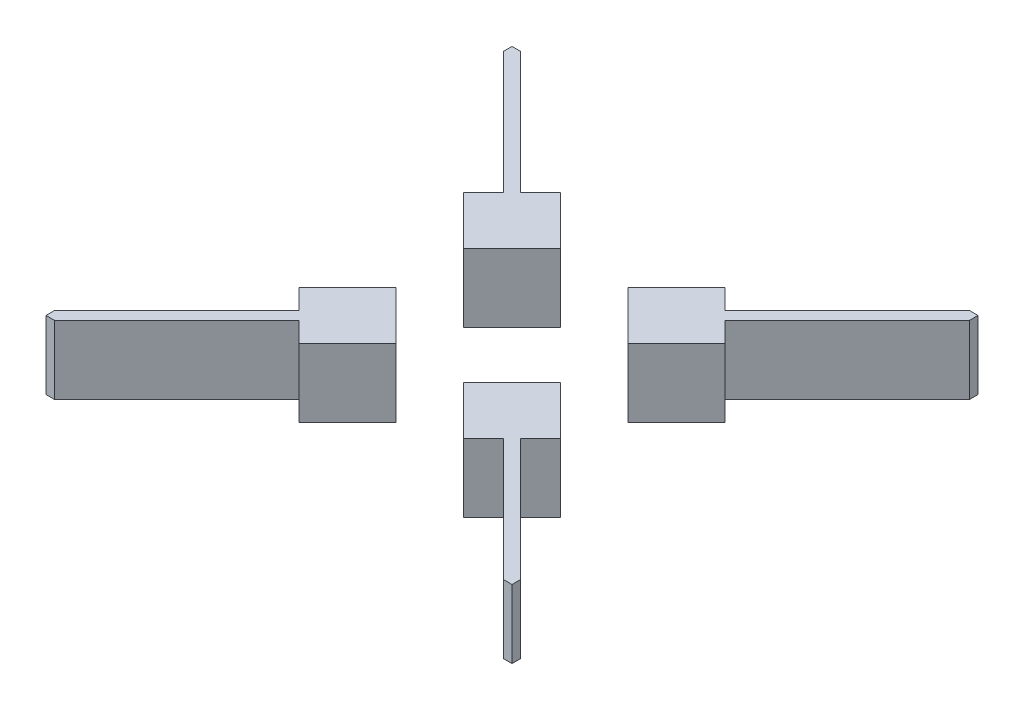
ISO-10303-21;
HEADER;
FILE_DESCRIPTION(('STEP AP214'),'2;1');
FILE_NAME('part.step','',(''),(''),'','','');
FILE_SCHEMA(('AUTOMOTIVE_DESIGN { 1 0 10303 214 1 1 1 1 }'));
ENDSEC;
DATA;
#1=APPLICATION_CONTEXT('core data for automotive mechanical design processes');
#2=APPLICATION_PROTOCOL_DEFINITION('international standard','automotive_design',2000,#1);
#3=PRODUCT_CONTEXT('',#1,'mechanical');
#4=PRODUCT('Part','Part','',(#3));
#5=PRODUCT_RELATED_PRODUCT_CATEGORY('part','',(#4));
#6=PRODUCT_DEFINITION_FORMATION('','',#4);
#7=PRODUCT_DEFINITION_CONTEXT('part definition',#1,'design');
#8=PRODUCT_DEFINITION('design','',#6,#7);
#9=PRODUCT_DEFINITION_SHAPE('','',#8);
#10=(LENGTH_UNIT() NAMED_UNIT(*) SI_UNIT(.MILLI.,.METRE.));
#11=(NAMED_UNIT(*) PLANE_ANGLE_UNIT() SI_UNIT($,.RADIAN.));
#12=(NAMED_UNIT(*) SI_UNIT($,.STERADIAN.) SOLID_ANGLE_UNIT());
#13=UNCERTAINTY_MEASURE_WITH_UNIT(LENGTH_MEASURE(1.E-05),#10,'distance_accuracy_value','');
#14=(GEOMETRIC_REPRESENTATION_CONTEXT(3) GLOBAL_UNCERTAINTY_ASSIGNED_CONTEXT((#13)) GLOBAL_UNIT_ASSIGNED_CONTEXT((#10,
#11,#12)) REPRESENTATION_CONTEXT('',''));
#15=CARTESIAN_POINT('',(0.,0.,0.));
#16=DIRECTION('',(0.,0.,1.));
#17=DIRECTION('',(1.,0.,0.));
#18=AXIS2_PLACEMENT_3D('',#15,#16,#17);
#19=CARTESIAN_POINT('',(9.53444210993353,5.,5.9989082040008));
#20=DIRECTION('',(-0.707106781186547,0.,0.707106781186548));
#21=DIRECTION('',(0.707106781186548,0.,0.707106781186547));
#22=AXIS2_PLACEMENT_3D('',#19,#20,#21);
#23=PLANE('',#22);
#24=DIRECTION('',(-0.707106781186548,0.,-0.707106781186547));
#25=VECTOR('',#24,1.);
#26=CARTESIAN_POINT('',(9.53444210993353,0.,5.9989082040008));
#27=LINE('',#26,#25);
#28=CARTESIAN_POINT('',(9.53444210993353,0.,5.9989082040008));
#29=VERTEX_POINT('',#28);
#30=CARTESIAN_POINT('',(5.9989082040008,0.,2.46337429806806));
#31=VERTEX_POINT('',#30);
#32=EDGE_CURVE('E152',#29,#31,#27,.T.);
#33=ORIENTED_EDGE('',*,*,#32,.T.);
#34=DIRECTION('',(0.,-1.,0.));
#35=VECTOR('',#34,1.);
#36=CARTESIAN_POINT('',(5.9989082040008,5.,2.46337429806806));
#37=LINE('',#36,#35);
#38=CARTESIAN_POINT('',(5.9989082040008,5.,2.46337429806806));
#39=VERTEX_POINT('',#38);
#40=EDGE_CURVE('E12',#39,#31,#37,.T.);
#41=ORIENTED_EDGE('',*,*,#40,.F.);
#42=DIRECTION('',(-0.707106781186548,0.,-0.707106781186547));
#43=VECTOR('',#42,1.);
#44=CARTESIAN_POINT('',(9.53444210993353,5.,5.9989082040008));
#45=LINE('',#44,#43);
#46=CARTESIAN_POINT('',(9.53444210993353,5.,5.9989082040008));
#47=VERTEX_POINT('',#46);
#48=EDGE_CURVE('E168',#47,#39,#45,.T.);
#49=ORIENTED_EDGE('',*,*,#48,.F.);
#50=DIRECTION('',(0.,-1.,0.));
#51=VECTOR('',#50,1.);
#52=CARTESIAN_POINT('',(9.53444210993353,5.,5.9989082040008));
#53=LINE('',#52,#51);
#54=EDGE_CURVE('E148',#47,#29,#53,.T.);
#55=ORIENTED_EDGE('',*,*,#54,.T.);
#56=EDGE_LOOP('',(#33,#41,#49,#55));
#57=FACE_BOUND('',#56,.T.);
#58=ADVANCED_FACE('F50',(#57),#23,.F.);
#59=CARTESIAN_POINT('',(5.9989082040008,5.,2.46337429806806));
#60=DIRECTION('',(0.707106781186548,0.,0.707106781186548));
#61=DIRECTION('',(0.707106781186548,0.,-0.707106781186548));
#62=AXIS2_PLACEMENT_3D('',#59,#60,#61);
#63=PLANE('',#62);
#64=DIRECTION('',(-0.707106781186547,0.,0.707106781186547));
#65=VECTOR('',#64,1.);
#66=CARTESIAN_POINT('',(5.9989082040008,0.,2.46337429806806));
#67=LINE('',#66,#65);
#68=CARTESIAN_POINT('',(2.46337429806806,0.,5.9989082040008));
#69=VERTEX_POINT('',#68);
#70=EDGE_CURVE('E155',#31,#69,#67,.T.);
#71=ORIENTED_EDGE('',*,*,#70,.T.);
#72=DIRECTION('',(0.,-1.,0.));
#73=VECTOR('',#72,1.);
#74=CARTESIAN_POINT('',(2.46337429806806,5.,5.9989082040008));
#75=LINE('',#74,#73);
#76=CARTESIAN_POINT('',(2.46337429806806,5.,5.9989082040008));
#77=VERTEX_POINT('',#76);
#78=EDGE_CURVE('E58',#77,#69,#75,.T.);
#79=ORIENTED_EDGE('',*,*,#78,.F.);
#80=DIRECTION('',(-0.707106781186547,0.,0.707106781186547));
#81=VECTOR('',#80,1.);
#82=CARTESIAN_POINT('',(5.9989082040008,5.,2.46337429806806));
#83=LINE('',#82,#81);
#84=EDGE_CURVE('E112',#39,#77,#83,.T.);
#85=ORIENTED_EDGE('',*,*,#84,.F.);
#86=ORIENTED_EDGE('',*,*,#40,.T.);
#87=EDGE_LOOP('',(#71,#79,#85,#86));
#88=FACE_BOUND('',#87,.T.);
#89=ADVANCED_FACE('F211',(#88),#63,.F.);
#90=CARTESIAN_POINT('',(5.9989082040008,5.,9.53444210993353));
#91=DIRECTION('',(0.707106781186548,0.,-0.707106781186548));
#92=DIRECTION('',(-0.707106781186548,0.,-0.707106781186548));
#93=AXIS2_PLACEMENT_3D('',#90,#91,#92);
#94=PLANE('',#93);
#95=DIRECTION('',(0.707106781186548,0.,0.707106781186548));
#96=VECTOR('',#95,1.);
#97=CARTESIAN_POINT('',(5.9989082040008,0.,9.53444210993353));
#98=LINE('',#97,#96);
#99=CARTESIAN_POINT('',(5.9989082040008,0.,9.53444210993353));
#100=VERTEX_POINT('',#99);
#101=EDGE_CURVE('E157',#69,#100,#98,.T.);
#102=ORIENTED_EDGE('',*,*,#101,.T.);
#103=DIRECTION('',(0.,-1.,0.));
#104=VECTOR('',#103,1.);
#105=CARTESIAN_POINT('',(5.9989082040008,5.,9.53444210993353));
#106=LINE('',#105,#104);
#107=CARTESIAN_POINT('',(5.9989082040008,5.,9.53444210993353));
#108=VERTEX_POINT('',#107);
#109=EDGE_CURVE('E178',#108,#100,#106,.T.);
#110=ORIENTED_EDGE('',*,*,#109,.F.);
#111=DIRECTION('',(0.707106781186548,0.,0.707106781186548));
#112=VECTOR('',#111,1.);
#113=CARTESIAN_POINT('',(5.9989082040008,5.,9.53444210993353));
#114=LINE('',#113,#112);
#115=EDGE_CURVE('E186',#77,#108,#114,.T.);
#116=ORIENTED_EDGE('',*,*,#115,.F.);
#117=ORIENTED_EDGE('',*,*,#78,.T.);
#118=EDGE_LOOP('',(#102,#110,#116,#117));
#119=FACE_BOUND('',#118,.T.);
#120=ADVANCED_FACE('F184',(#119),#94,.F.);
#121=CARTESIAN_POINT('',(7.44900397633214,5.,8.0843463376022));
#122=DIRECTION('',(-0.707106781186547,0.,-0.707106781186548));
#123=DIRECTION('',(-0.707106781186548,0.,0.707106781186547));
#124=AXIS2_PLACEMENT_3D('',#121,#122,#123);
#125=PLANE('',#124);
#126=DIRECTION('',(0.707106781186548,0.,-0.707106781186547));
#127=VECTOR('',#126,1.);
#128=CARTESIAN_POINT('',(7.44900397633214,0.,8.0843463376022));
#129=LINE('',#128,#127);
#130=CARTESIAN_POINT('',(7.44900397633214,0.,8.0843463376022));
#131=VERTEX_POINT('',#130);
#132=EDGE_CURVE('E159',#100,#131,#129,.T.);
#133=ORIENTED_EDGE('',*,*,#132,.T.);
#134=DIRECTION('',(0.,-1.,0.));
#135=VECTOR('',#134,1.);
#136=CARTESIAN_POINT('',(7.44900397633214,5.,8.0843463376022));
#137=LINE('',#136,#135);
#138=CARTESIAN_POINT('',(7.44900397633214,5.,8.0843463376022));
#139=VERTEX_POINT('',#138);
#140=EDGE_CURVE('E175',#139,#131,#137,.T.);
#141=ORIENTED_EDGE('',*,*,#140,.F.);
#142=DIRECTION('',(0.707106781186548,0.,-0.707106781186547));
#143=VECTOR('',#142,1.);
#144=CARTESIAN_POINT('',(7.44900397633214,5.,8.0843463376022));
#145=LINE('',#144,#143);
#146=EDGE_CURVE('E202',#108,#139,#145,.T.);
#147=ORIENTED_EDGE('',*,*,#146,.F.);
#148=ORIENTED_EDGE('',*,*,#109,.T.);
#149=EDGE_LOOP('',(#133,#141,#147,#148));
#150=FACE_BOUND('',#149,.T.);
#151=ADVANCED_FACE('F195',(#150),#125,.F.);
#152=CARTESIAN_POINT('',(7.44900397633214,5.,8.0843463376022));
#153=DIRECTION('',(0.707106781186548,0.,-0.707106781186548));
#154=DIRECTION('',(-0.707106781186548,0.,-0.707106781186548));
#155=AXIS2_PLACEMENT_3D('',#152,#153,#154);
#156=PLANE('',#155);
#157=DIRECTION('',(0.707106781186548,0.,0.707106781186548));
#158=VECTOR('',#157,1.);
#159=CARTESIAN_POINT('',(7.44900397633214,0.,8.0843463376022));
#160=LINE('',#159,#158);
#161=CARTESIAN_POINT('',(16.3646576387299,0.,17.));
#162=VERTEX_POINT('',#161);
#163=EDGE_CURVE('E161',#131,#162,#160,.T.);
#164=ORIENTED_EDGE('',*,*,#163,.T.);
#165=DIRECTION('',(0.,-1.,0.));
#166=VECTOR('',#165,1.);
#167=CARTESIAN_POINT('',(16.3646576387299,5.,17.));
#168=LINE('',#167,#166);
#169=CARTESIAN_POINT('',(16.3646576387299,5.,17.));
#170=VERTEX_POINT('',#169);
#171=EDGE_CURVE('E172',#170,#162,#168,.T.);
#172=ORIENTED_EDGE('',*,*,#171,.F.);
#173=DIRECTION('',(0.707106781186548,0.,0.707106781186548));
#174=VECTOR('',#173,1.);
#175=CARTESIAN_POINT('',(7.44900397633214,5.,8.0843463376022));
#176=LINE('',#175,#174);
#177=EDGE_CURVE('E201',#139,#170,#176,.T.);
#178=ORIENTED_EDGE('',*,*,#177,.F.);
#179=ORIENTED_EDGE('',*,*,#140,.T.);
#180=EDGE_LOOP('',(#164,#172,#178,#179));
#181=FACE_BOUND('',#180,.T.);
#182=ADVANCED_FACE('F199',(#181),#156,.F.);
#183=CARTESIAN_POINT('',(17.,5.,17.));
#184=DIRECTION('',(0.,0.,-1.));
#185=DIRECTION('',(-1.,0.,0.));
#186=AXIS2_PLACEMENT_3D('',#183,#184,#185);
#187=PLANE('',#186);
#188=DIRECTION('',(1.,0.,0.));
#189=VECTOR('',#188,1.);
#190=CARTESIAN_POINT('',(17.,0.,17.));
#191=LINE('',#190,#189);
#192=CARTESIAN_POINT('',(17.,0.,17.));
#193=VERTEX_POINT('',#192);
#194=EDGE_CURVE('E163',#162,#193,#191,.T.);
#195=ORIENTED_EDGE('',*,*,#194,.T.);
#196=DIRECTION('',(0.,-1.,0.));
#197=VECTOR('',#196,1.);
#198=CARTESIAN_POINT('',(17.,5.,17.));
#199=LINE('',#198,#197);
#200=CARTESIAN_POINT('',(17.,5.,17.));
#201=VERTEX_POINT('',#200);
#202=EDGE_CURVE('E143',#201,#193,#199,.T.);
#203=ORIENTED_EDGE('',*,*,#202,.F.);
#204=DIRECTION('',(1.,0.,0.));
#205=VECTOR('',#204,1.);
#206=CARTESIAN_POINT('',(17.,5.,17.));
#207=LINE('',#206,#205);
#208=EDGE_CURVE('E134',#170,#201,#207,.T.);
#209=ORIENTED_EDGE('',*,*,#208,.F.);
#210=ORIENTED_EDGE('',*,*,#171,.T.);
#211=EDGE_LOOP('',(#195,#203,#209,#210));
#212=FACE_BOUND('',#211,.T.);
#213=ADVANCED_FACE('F223',(#212),#187,.F.);
#214=CARTESIAN_POINT('',(17.,5.,17.));
#215=DIRECTION('',(-1.,0.,0.));
#216=DIRECTION('',(0.,0.,1.));
#217=AXIS2_PLACEMENT_3D('',#214,#215,#216);
#218=PLANE('',#217);
#219=DIRECTION('',(0.,0.,-1.));
#220=VECTOR('',#219,1.);
#221=CARTESIAN_POINT('',(17.,0.,17.));
#222=LINE('',#221,#220);
#223=CARTESIAN_POINT('',(17.,0.,16.3646576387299));
#224=VERTEX_POINT('',#223);
#225=EDGE_CURVE('E142',#193,#224,#222,.T.);
#226=ORIENTED_EDGE('',*,*,#225,.T.);
#227=DIRECTION('',(0.,-1.,0.));
#228=VECTOR('',#227,1.);
#229=CARTESIAN_POINT('',(17.,5.,16.3646576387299));
#230=LINE('',#229,#228);
#231=CARTESIAN_POINT('',(17.,5.,16.3646576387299));
#232=VERTEX_POINT('',#231);
#233=EDGE_CURVE('E139',#232,#224,#230,.T.);
#234=ORIENTED_EDGE('',*,*,#233,.F.);
#235=DIRECTION('',(0.,0.,-1.));
#236=VECTOR('',#235,1.);
#237=CARTESIAN_POINT('',(17.,5.,17.));
#238=LINE('',#237,#236);
#239=EDGE_CURVE('E128',#201,#232,#238,.T.);
#240=ORIENTED_EDGE('',*,*,#239,.F.);
#241=ORIENTED_EDGE('',*,*,#202,.T.);
#242=EDGE_LOOP('',(#226,#234,#240,#241));
#243=FACE_BOUND('',#242,.T.);
#244=ADVANCED_FACE('F140',(#243),#218,.F.);
#245=CARTESIAN_POINT('',(8.0843463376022,5.,7.44900397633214));
#246=DIRECTION('',(-0.707106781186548,0.,0.707106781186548));
#247=DIRECTION('',(0.707106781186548,0.,0.707106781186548));
#248=AXIS2_PLACEMENT_3D('',#245,#246,#247);
#249=PLANE('',#248);
#250=DIRECTION('',(-0.707106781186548,0.,-0.707106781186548));
#251=VECTOR('',#250,1.);
#252=CARTESIAN_POINT('',(8.0843463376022,0.,7.44900397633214));
#253=LINE('',#252,#251);
#254=CARTESIAN_POINT('',(8.0843463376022,0.,7.44900397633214));
#255=VERTEX_POINT('',#254);
#256=EDGE_CURVE('E98',#224,#255,#253,.T.);
#257=ORIENTED_EDGE('',*,*,#256,.T.);
#258=DIRECTION('',(0.,-1.,0.));
#259=VECTOR('',#258,1.);
#260=CARTESIAN_POINT('',(8.0843463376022,5.,7.44900397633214));
#261=LINE('',#260,#259);
#262=CARTESIAN_POINT('',(8.0843463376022,5.,7.44900397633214));
#263=VERTEX_POINT('',#262);
#264=EDGE_CURVE('E144',#263,#255,#261,.T.);
#265=ORIENTED_EDGE('',*,*,#264,.F.);
#266=DIRECTION('',(-0.707106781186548,0.,-0.707106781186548));
#267=VECTOR('',#266,1.);
#268=CARTESIAN_POINT('',(8.0843463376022,5.,7.44900397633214));
#269=LINE('',#268,#267);
#270=EDGE_CURVE('E132',#232,#263,#269,.T.);
#271=ORIENTED_EDGE('',*,*,#270,.F.);
#272=ORIENTED_EDGE('',*,*,#233,.T.);
#273=EDGE_LOOP('',(#257,#265,#271,#272));
#274=FACE_BOUND('',#273,.T.);
#275=ADVANCED_FACE('F146',(#274),#249,.F.);
#276=CARTESIAN_POINT('',(9.53444210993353,5.,5.9989082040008));
#277=DIRECTION('',(-0.707106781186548,0.,-0.707106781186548));
#278=DIRECTION('',(-0.707106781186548,0.,0.707106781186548));
#279=AXIS2_PLACEMENT_3D('',#276,#277,#278);
#280=PLANE('',#279);
#281=DIRECTION('',(0.707106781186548,0.,-0.707106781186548));
#282=VECTOR('',#281,1.);
#283=CARTESIAN_POINT('',(9.53444210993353,0.,5.9989082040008));
#284=LINE('',#283,#282);
#285=EDGE_CURVE('E104',#255,#29,#284,.T.);
#286=ORIENTED_EDGE('',*,*,#285,.T.);
#287=ORIENTED_EDGE('',*,*,#54,.F.);
#288=DIRECTION('',(0.707106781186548,0.,-0.707106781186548));
#289=VECTOR('',#288,1.);
#290=CARTESIAN_POINT('',(9.53444210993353,5.,5.9989082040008));
#291=LINE('',#290,#289);
#292=EDGE_CURVE('E66',#263,#47,#291,.T.);
#293=ORIENTED_EDGE('',*,*,#292,.F.);
#294=ORIENTED_EDGE('',*,*,#264,.T.);
#295=EDGE_LOOP('',(#286,#287,#293,#294));
#296=FACE_BOUND('',#295,.T.);
#297=ADVANCED_FACE('F231',(#296),#280,.F.);
#298=CARTESIAN_POINT('',(0.,5.,0.));
#299=DIRECTION('',(0.,1.,0.));
#300=DIRECTION('',(0.,0.,1.));
#301=AXIS2_PLACEMENT_3D('',#298,#299,#300);
#302=PLANE('',#301);
#303=ORIENTED_EDGE('',*,*,#48,.T.);
#304=ORIENTED_EDGE('',*,*,#84,.T.);
#305=ORIENTED_EDGE('',*,*,#115,.T.);
#306=ORIENTED_EDGE('',*,*,#146,.T.);
#307=ORIENTED_EDGE('',*,*,#177,.T.);
#308=ORIENTED_EDGE('',*,*,#208,.T.);
#309=ORIENTED_EDGE('',*,*,#239,.T.);
#310=ORIENTED_EDGE('',*,*,#270,.T.);
#311=ORIENTED_EDGE('',*,*,#292,.T.);
#312=EDGE_LOOP('',(#303,#304,#305,#306,#307,#308,#309,#310,#311));
#313=FACE_BOUND('',#312,.T.);
#314=ADVANCED_FACE('F130',(#313),#302,.T.);
#315=CARTESIAN_POINT('',(0.,0.,0.));
#316=DIRECTION('',(0.,1.,0.));
#317=DIRECTION('',(0.,0.,1.));
#318=AXIS2_PLACEMENT_3D('',#315,#316,#317);
#319=PLANE('',#318);
#320=ORIENTED_EDGE('',*,*,#32,.F.);
#321=ORIENTED_EDGE('',*,*,#285,.F.);
#322=ORIENTED_EDGE('',*,*,#256,.F.);
#323=ORIENTED_EDGE('',*,*,#225,.F.);
#324=ORIENTED_EDGE('',*,*,#194,.F.);
#325=ORIENTED_EDGE('',*,*,#163,.F.);
#326=ORIENTED_EDGE('',*,*,#132,.F.);
#327=ORIENTED_EDGE('',*,*,#101,.F.);
#328=ORIENTED_EDGE('',*,*,#70,.F.);
#329=EDGE_LOOP('',(#320,#321,#322,#323,#324,#325,#326,#327,#328));
#330=FACE_BOUND('',#329,.T.);
#331=ADVANCED_FACE('F190',(#330),#319,.F.);
#332=CLOSED_SHELL('',(#58,#89,#120,#151,#182,#213,#244,#275,#297,#314,#331));
#333=MANIFOLD_SOLID_BREP('B2',#332);
#334=CARTESIAN_POINT('',(-9.53444210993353,5.,5.9989082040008));
#335=DIRECTION('',(0.707106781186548,0.,-0.707106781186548));
#336=DIRECTION('',(-0.707106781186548,0.,-0.707106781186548));
#337=AXIS2_PLACEMENT_3D('',#334,#335,#336);
#338=PLANE('',#337);
#339=DIRECTION('',(0.707106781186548,0.,0.707106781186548));
#340=VECTOR('',#339,1.);
#341=CARTESIAN_POINT('',(-9.53444210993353,0.,5.9989082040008));
#342=LINE('',#341,#340);
#343=CARTESIAN_POINT('',(-9.53444210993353,0.,5.9989082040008));
#344=VERTEX_POINT('',#343);
#345=CARTESIAN_POINT('',(-8.0843463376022,0.,7.44900397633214));
#346=VERTEX_POINT('',#345);
#347=EDGE_CURVE('E416',#344,#346,#342,.T.);
#348=ORIENTED_EDGE('',*,*,#347,.T.);
#349=DIRECTION('',(0.,-1.,0.));
#350=VECTOR('',#349,1.);
#351=CARTESIAN_POINT('',(-8.0843463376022,5.,7.44900397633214));
#352=LINE('',#351,#350);
#353=CARTESIAN_POINT('',(-8.0843463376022,5.,7.44900397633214));
#354=VERTEX_POINT('',#353);
#355=EDGE_CURVE('E48',#354,#346,#352,.T.);
#356=ORIENTED_EDGE('',*,*,#355,.F.);
#357=DIRECTION('',(0.707106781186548,0.,0.707106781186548));
#358=VECTOR('',#357,1.);
#359=CARTESIAN_POINT('',(-9.53444210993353,5.,5.9989082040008));
#360=LINE('',#359,#358);
#361=CARTESIAN_POINT('',(-9.53444210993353,5.,5.9989082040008));
#362=VERTEX_POINT('',#361);
#363=EDGE_CURVE('E432',#362,#354,#360,.T.);
#364=ORIENTED_EDGE('',*,*,#363,.F.);
#365=DIRECTION('',(0.,-1.,0.));
#366=VECTOR('',#365,1.);
#367=CARTESIAN_POINT('',(-9.53444210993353,5.,5.9989082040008));
#368=LINE('',#367,#366);
#369=EDGE_CURVE('E412',#362,#344,#368,.T.);
#370=ORIENTED_EDGE('',*,*,#369,.T.);
#371=EDGE_LOOP('',(#348,#356,#364,#370));
#372=FACE_BOUND('',#371,.T.);
#373=ADVANCED_FACE('F314',(#372),#338,.F.);
#374=CARTESIAN_POINT('',(-8.0843463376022,5.,7.44900397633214));
#375=DIRECTION('',(0.707106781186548,0.,0.707106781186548));
#376=DIRECTION('',(0.707106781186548,0.,-0.707106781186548));
#377=AXIS2_PLACEMENT_3D('',#374,#375,#376);
#378=PLANE('',#377);
#379=DIRECTION('',(-0.707106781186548,0.,0.707106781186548));
#380=VECTOR('',#379,1.);
#381=CARTESIAN_POINT('',(-8.0843463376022,0.,7.44900397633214));
#382=LINE('',#381,#380);
#383=CARTESIAN_POINT('',(-17.,0.,16.3646576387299));
#384=VERTEX_POINT('',#383);
#385=EDGE_CURVE('E419',#346,#384,#382,.T.);
#386=ORIENTED_EDGE('',*,*,#385,.T.);
#387=DIRECTION('',(0.,-1.,0.));
#388=VECTOR('',#387,1.);
#389=CARTESIAN_POINT('',(-17.,5.,16.3646576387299));
#390=LINE('',#389,#388);
#391=CARTESIAN_POINT('',(-17.,5.,16.3646576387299));
#392=VERTEX_POINT('',#391);
#393=EDGE_CURVE('E322',#392,#384,#390,.T.);
#394=ORIENTED_EDGE('',*,*,#393,.F.);
#395=DIRECTION('',(-0.707106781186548,0.,0.707106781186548));
#396=VECTOR('',#395,1.);
#397=CARTESIAN_POINT('',(-8.0843463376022,5.,7.44900397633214));
#398=LINE('',#397,#396);
#399=EDGE_CURVE('E376',#354,#392,#398,.T.);
#400=ORIENTED_EDGE('',*,*,#399,.F.);
#401=ORIENTED_EDGE('',*,*,#355,.T.);
#402=EDGE_LOOP('',(#386,#394,#400,#401));
#403=FACE_BOUND('',#402,.T.);
#404=ADVANCED_FACE('F475',(#403),#378,.F.);
#405=CARTESIAN_POINT('',(-17.,5.,17.));
#406=DIRECTION('',(1.,0.,0.));
#407=DIRECTION('',(0.,0.,-1.));
#408=AXIS2_PLACEMENT_3D('',#405,#406,#407);
#409=PLANE('',#408);
#410=DIRECTION('',(0.,0.,1.));
#411=VECTOR('',#410,1.);
#412=CARTESIAN_POINT('',(-17.,0.,17.));
#413=LINE('',#412,#411);
#414=CARTESIAN_POINT('',(-17.,0.,17.));
#415=VERTEX_POINT('',#414);
#416=EDGE_CURVE('E421',#384,#415,#413,.T.);
#417=ORIENTED_EDGE('',*,*,#416,.T.);
#418=DIRECTION('',(0.,-1.,0.));
#419=VECTOR('',#418,1.);
#420=CARTESIAN_POINT('',(-17.,5.,17.));
#421=LINE('',#420,#419);
#422=CARTESIAN_POINT('',(-17.,5.,17.));
#423=VERTEX_POINT('',#422);
#424=EDGE_CURVE('E442',#423,#415,#421,.T.);
#425=ORIENTED_EDGE('',*,*,#424,.F.);
#426=DIRECTION('',(0.,0.,1.));
#427=VECTOR('',#426,1.);
#428=CARTESIAN_POINT('',(-17.,5.,17.));
#429=LINE('',#428,#427);
#430=EDGE_CURVE('E450',#392,#423,#429,.T.);
#431=ORIENTED_EDGE('',*,*,#430,.F.);
#432=ORIENTED_EDGE('',*,*,#393,.T.);
#433=EDGE_LOOP('',(#417,#425,#431,#432));
#434=FACE_BOUND('',#433,.T.);
#435=ADVANCED_FACE('F448',(#434),#409,.F.);
#436=CARTESIAN_POINT('',(-17.,5.,17.));
#437=DIRECTION('',(0.,0.,-1.));
#438=DIRECTION('',(-1.,0.,0.));
#439=AXIS2_PLACEMENT_3D('',#436,#437,#438);
#440=PLANE('',#439);
#441=DIRECTION('',(1.,0.,0.));
#442=VECTOR('',#441,1.);
#443=CARTESIAN_POINT('',(-17.,0.,17.));
#444=LINE('',#443,#442);
#445=CARTESIAN_POINT('',(-16.3646576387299,0.,17.));
#446=VERTEX_POINT('',#445);
#447=EDGE_CURVE('E423',#415,#446,#444,.T.);
#448=ORIENTED_EDGE('',*,*,#447,.T.);
#449=DIRECTION('',(0.,-1.,0.));
#450=VECTOR('',#449,1.);
#451=CARTESIAN_POINT('',(-16.3646576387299,5.,17.));
#452=LINE('',#451,#450);
#453=CARTESIAN_POINT('',(-16.3646576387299,5.,17.));
#454=VERTEX_POINT('',#453);
#455=EDGE_CURVE('E439',#454,#446,#452,.T.);
#456=ORIENTED_EDGE('',*,*,#455,.F.);
#457=DIRECTION('',(1.,0.,0.));
#458=VECTOR('',#457,1.);
#459=CARTESIAN_POINT('',(-17.,5.,17.));
#460=LINE('',#459,#458);
#461=EDGE_CURVE('E466',#423,#454,#460,.T.);
#462=ORIENTED_EDGE('',*,*,#461,.F.);
#463=ORIENTED_EDGE('',*,*,#424,.T.);
#464=EDGE_LOOP('',(#448,#456,#462,#463));
#465=FACE_BOUND('',#464,.T.);
#466=ADVANCED_FACE('F459',(#465),#440,.F.);
#467=CARTESIAN_POINT('',(-7.44900397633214,5.,8.0843463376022));
#468=DIRECTION('',(-0.707106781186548,0.,-0.707106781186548));
#469=DIRECTION('',(-0.707106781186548,0.,0.707106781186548));
#470=AXIS2_PLACEMENT_3D('',#467,#468,#469);
#471=PLANE('',#470);
#472=DIRECTION('',(0.707106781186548,0.,-0.707106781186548));
#473=VECTOR('',#472,1.);
#474=CARTESIAN_POINT('',(-7.44900397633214,0.,8.0843463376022));
#475=LINE('',#474,#473);
#476=CARTESIAN_POINT('',(-7.44900397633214,0.,8.0843463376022));
#477=VERTEX_POINT('',#476);
#478=EDGE_CURVE('E425',#446,#477,#475,.T.);
#479=ORIENTED_EDGE('',*,*,#478,.T.);
#480=DIRECTION('',(0.,-1.,0.));
#481=VECTOR('',#480,1.);
#482=CARTESIAN_POINT('',(-7.44900397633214,5.,8.0843463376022));
#483=LINE('',#482,#481);
#484=CARTESIAN_POINT('',(-7.44900397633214,5.,8.0843463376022));
#485=VERTEX_POINT('',#484);
#486=EDGE_CURVE('E436',#485,#477,#483,.T.);
#487=ORIENTED_EDGE('',*,*,#486,.F.);
#488=DIRECTION('',(0.707106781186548,0.,-0.707106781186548));
#489=VECTOR('',#488,1.);
#490=CARTESIAN_POINT('',(-7.44900397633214,5.,8.0843463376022));
#491=LINE('',#490,#489);
#492=EDGE_CURVE('E465',#454,#485,#491,.T.);
#493=ORIENTED_EDGE('',*,*,#492,.F.);
#494=ORIENTED_EDGE('',*,*,#455,.T.);
#495=EDGE_LOOP('',(#479,#487,#493,#494));
#496=FACE_BOUND('',#495,.T.);
#497=ADVANCED_FACE('F463',(#496),#471,.F.);
#498=CARTESIAN_POINT('',(-7.44900397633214,5.,8.0843463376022));
#499=DIRECTION('',(0.707106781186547,0.,-0.707106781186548));
#500=DIRECTION('',(-0.707106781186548,0.,-0.707106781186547));
#501=AXIS2_PLACEMENT_3D('',#498,#499,#500);
#502=PLANE('',#501);
#503=DIRECTION('',(0.707106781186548,0.,0.707106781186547));
#504=VECTOR('',#503,1.);
#505=CARTESIAN_POINT('',(-7.44900397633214,0.,8.0843463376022));
#506=LINE('',#505,#504);
#507=CARTESIAN_POINT('',(-5.9989082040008,0.,9.53444210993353));
#508=VERTEX_POINT('',#507);
#509=EDGE_CURVE('E427',#477,#508,#506,.T.);
#510=ORIENTED_EDGE('',*,*,#509,.T.);
#511=DIRECTION('',(0.,-1.,0.));
#512=VECTOR('',#511,1.);
#513=CARTESIAN_POINT('',(-5.9989082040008,5.,9.53444210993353));
#514=LINE('',#513,#512);
#515=CARTESIAN_POINT('',(-5.9989082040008,5.,9.53444210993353));
#516=VERTEX_POINT('',#515);
#517=EDGE_CURVE('E407',#516,#508,#514,.T.);
#518=ORIENTED_EDGE('',*,*,#517,.F.);
#519=DIRECTION('',(0.707106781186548,0.,0.707106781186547));
#520=VECTOR('',#519,1.);
#521=CARTESIAN_POINT('',(-7.44900397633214,5.,8.0843463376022));
#522=LINE('',#521,#520);
#523=EDGE_CURVE('E398',#485,#516,#522,.T.);
#524=ORIENTED_EDGE('',*,*,#523,.F.);
#525=ORIENTED_EDGE('',*,*,#486,.T.);
#526=EDGE_LOOP('',(#510,#518,#524,#525));
#527=FACE_BOUND('',#526,.T.);
#528=ADVANCED_FACE('F487',(#527),#502,.F.);
#529=CARTESIAN_POINT('',(-5.9989082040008,5.,9.53444210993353));
#530=DIRECTION('',(-0.707106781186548,0.,-0.707106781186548));
#531=DIRECTION('',(-0.707106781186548,0.,0.707106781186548));
#532=AXIS2_PLACEMENT_3D('',#529,#530,#531);
#533=PLANE('',#532);
#534=DIRECTION('',(0.707106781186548,0.,-0.707106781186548));
#535=VECTOR('',#534,1.);
#536=CARTESIAN_POINT('',(-5.9989082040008,0.,9.53444210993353));
#537=LINE('',#536,#535);
#538=CARTESIAN_POINT('',(-2.46337429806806,0.,5.9989082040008));
#539=VERTEX_POINT('',#538);
#540=EDGE_CURVE('E406',#508,#539,#537,.T.);
#541=ORIENTED_EDGE('',*,*,#540,.T.);
#542=DIRECTION('',(0.,-1.,0.));
#543=VECTOR('',#542,1.);
#544=CARTESIAN_POINT('',(-2.46337429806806,5.,5.9989082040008));
#545=LINE('',#544,#543);
#546=CARTESIAN_POINT('',(-2.46337429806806,5.,5.9989082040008));
#547=VERTEX_POINT('',#546);
#548=EDGE_CURVE('E403',#547,#539,#545,.T.);
#549=ORIENTED_EDGE('',*,*,#548,.F.);
#550=DIRECTION('',(0.707106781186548,0.,-0.707106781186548));
#551=VECTOR('',#550,1.);
#552=CARTESIAN_POINT('',(-5.9989082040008,5.,9.53444210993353));
#553=LINE('',#552,#551);
#554=EDGE_CURVE('E392',#516,#547,#553,.T.);
#555=ORIENTED_EDGE('',*,*,#554,.F.);
#556=ORIENTED_EDGE('',*,*,#517,.T.);
#557=EDGE_LOOP('',(#541,#549,#555,#556));
#558=FACE_BOUND('',#557,.T.);
#559=ADVANCED_FACE('F404',(#558),#533,.F.);
#560=CARTESIAN_POINT('',(-5.9989082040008,5.,2.46337429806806));
#561=DIRECTION('',(-0.707106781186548,0.,0.707106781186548));
#562=DIRECTION('',(0.707106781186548,0.,0.707106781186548));
#563=AXIS2_PLACEMENT_3D('',#560,#561,#562);
#564=PLANE('',#563);
#565=DIRECTION('',(-0.707106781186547,0.,-0.707106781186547));
#566=VECTOR('',#565,1.);
#567=CARTESIAN_POINT('',(-5.9989082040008,0.,2.46337429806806));
#568=LINE('',#567,#566);
#569=CARTESIAN_POINT('',(-5.9989082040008,0.,2.46337429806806));
#570=VERTEX_POINT('',#569);
#571=EDGE_CURVE('E362',#539,#570,#568,.T.);
#572=ORIENTED_EDGE('',*,*,#571,.T.);
#573=DIRECTION('',(0.,-1.,0.));
#574=VECTOR('',#573,1.);
#575=CARTESIAN_POINT('',(-5.9989082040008,5.,2.46337429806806));
#576=LINE('',#575,#574);
#577=CARTESIAN_POINT('',(-5.9989082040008,5.,2.46337429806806));
#578=VERTEX_POINT('',#577);
#579=EDGE_CURVE('E408',#578,#570,#576,.T.);
#580=ORIENTED_EDGE('',*,*,#579,.F.);
#581=DIRECTION('',(-0.707106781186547,0.,-0.707106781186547));
#582=VECTOR('',#581,1.);
#583=CARTESIAN_POINT('',(-5.9989082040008,5.,2.46337429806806));
#584=LINE('',#583,#582);
#585=EDGE_CURVE('E396',#547,#578,#584,.T.);
#586=ORIENTED_EDGE('',*,*,#585,.F.);
#587=ORIENTED_EDGE('',*,*,#548,.T.);
#588=EDGE_LOOP('',(#572,#580,#586,#587));
#589=FACE_BOUND('',#588,.T.);
#590=ADVANCED_FACE('F410',(#589),#564,.F.);
#591=CARTESIAN_POINT('',(-9.53444210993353,5.,5.9989082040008));
#592=DIRECTION('',(0.707106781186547,0.,0.707106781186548));
#593=DIRECTION('',(0.707106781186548,0.,-0.707106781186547));
#594=AXIS2_PLACEMENT_3D('',#591,#592,#593);
#595=PLANE('',#594);
#596=DIRECTION('',(-0.707106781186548,0.,0.707106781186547));
#597=VECTOR('',#596,1.);
#598=CARTESIAN_POINT('',(-9.53444210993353,0.,5.9989082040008));
#599=LINE('',#598,#597);
#600=EDGE_CURVE('E368',#570,#344,#599,.T.);
#601=ORIENTED_EDGE('',*,*,#600,.T.);
#602=ORIENTED_EDGE('',*,*,#369,.F.);
#603=DIRECTION('',(-0.707106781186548,0.,0.707106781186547));
#604=VECTOR('',#603,1.);
#605=CARTESIAN_POINT('',(-9.53444210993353,5.,5.9989082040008));
#606=LINE('',#605,#604);
#607=EDGE_CURVE('E330',#578,#362,#606,.T.);
#608=ORIENTED_EDGE('',*,*,#607,.F.);
#609=ORIENTED_EDGE('',*,*,#579,.T.);
#610=EDGE_LOOP('',(#601,#602,#608,#609));
#611=FACE_BOUND('',#610,.T.);
#612=ADVANCED_FACE('F495',(#611),#595,.F.);
#613=CARTESIAN_POINT('',(0.,5.,0.));
#614=DIRECTION('',(0.,-1.,0.));
#615=DIRECTION('',(0.,0.,-1.));
#616=AXIS2_PLACEMENT_3D('',#613,#614,#615);
#617=PLANE('',#616);
#618=ORIENTED_EDGE('',*,*,#363,.T.);
#619=ORIENTED_EDGE('',*,*,#399,.T.);
#620=ORIENTED_EDGE('',*,*,#430,.T.);
#621=ORIENTED_EDGE('',*,*,#461,.T.);
#622=ORIENTED_EDGE('',*,*,#492,.T.);
#623=ORIENTED_EDGE('',*,*,#523,.T.);
#624=ORIENTED_EDGE('',*,*,#554,.T.);
#625=ORIENTED_EDGE('',*,*,#585,.T.);
#626=ORIENTED_EDGE('',*,*,#607,.T.);
#627=EDGE_LOOP('',(#618,#619,#620,#621,#622,#623,#624,#625,#626));
#628=FACE_BOUND('',#627,.T.);
#629=ADVANCED_FACE('F394',(#628),#617,.F.);
#630=CARTESIAN_POINT('',(0.,0.,0.));
#631=DIRECTION('',(0.,-1.,0.));
#632=DIRECTION('',(0.,0.,-1.));
#633=AXIS2_PLACEMENT_3D('',#630,#631,#632);
#634=PLANE('',#633);
#635=ORIENTED_EDGE('',*,*,#347,.F.);
#636=ORIENTED_EDGE('',*,*,#600,.F.);
#637=ORIENTED_EDGE('',*,*,#571,.F.);
#638=ORIENTED_EDGE('',*,*,#540,.F.);
#639=ORIENTED_EDGE('',*,*,#509,.F.);
#640=ORIENTED_EDGE('',*,*,#478,.F.);
#641=ORIENTED_EDGE('',*,*,#447,.F.);
#642=ORIENTED_EDGE('',*,*,#416,.F.);
#643=ORIENTED_EDGE('',*,*,#385,.F.);
#644=EDGE_LOOP('',(#635,#636,#637,#638,#639,#640,#641,#642,#643));
#645=FACE_BOUND('',#644,.T.);
#646=ADVANCED_FACE('F454',(#645),#634,.T.);
#647=CLOSED_SHELL('',(#373,#404,#435,#466,#497,#528,#559,#590,#612,#629,#646));
#648=MANIFOLD_SOLID_BREP('B6',#647);
#649=CARTESIAN_POINT('',(-17.,5.,-17.));
#650=DIRECTION('',(0.,0.,1.));
#651=DIRECTION('',(1.,0.,0.));
#652=AXIS2_PLACEMENT_3D('',#649,#650,#651);
#653=PLANE('',#652);
#654=DIRECTION('',(-1.,0.,0.));
#655=VECTOR('',#654,1.);
#656=CARTESIAN_POINT('',(-17.,0.,-17.));
#657=LINE('',#656,#655);
#658=CARTESIAN_POINT('',(-16.3646576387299,0.,-17.));
#659=VERTEX_POINT('',#658);
#660=CARTESIAN_POINT('',(-17.,0.,-17.));
#661=VERTEX_POINT('',#660);
#662=EDGE_CURVE('E684',#659,#661,#657,.T.);
#663=ORIENTED_EDGE('',*,*,#662,.T.);
#664=DIRECTION('',(0.,-1.,0.));
#665=VECTOR('',#664,1.);
#666=CARTESIAN_POINT('',(-17.,5.,-17.));
#667=LINE('',#666,#665);
#668=CARTESIAN_POINT('',(-17.,5.,-17.));
#669=VERTEX_POINT('',#668);
#670=EDGE_CURVE('E312',#669,#661,#667,.T.);
#671=ORIENTED_EDGE('',*,*,#670,.F.);
#672=DIRECTION('',(-1.,0.,0.));
#673=VECTOR('',#672,1.);
#674=CARTESIAN_POINT('',(-17.,5.,-17.));
#675=LINE('',#674,#673);
#676=CARTESIAN_POINT('',(-16.3646576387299,5.,-17.));
#677=VERTEX_POINT('',#676);
#678=EDGE_CURVE('E709',#677,#669,#675,.T.);
#679=ORIENTED_EDGE('',*,*,#678,.F.);
#680=DIRECTION('',(0.,-1.,0.));
#681=VECTOR('',#680,1.);
#682=CARTESIAN_POINT('',(-16.3646576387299,5.,-17.));
#683=LINE('',#682,#681);
#684=EDGE_CURVE('E680',#677,#659,#683,.T.);
#685=ORIENTED_EDGE('',*,*,#684,.T.);
#686=EDGE_LOOP('',(#663,#671,#679,#685));
#687=FACE_BOUND('',#686,.T.);
#688=ADVANCED_FACE('F577',(#687),#653,.F.);
#689=CARTESIAN_POINT('',(-17.,5.,-17.));
#690=DIRECTION('',(1.,0.,0.));
#691=DIRECTION('',(0.,0.,-1.));
#692=AXIS2_PLACEMENT_3D('',#689,#690,#691);
#693=PLANE('',#692);
#694=DIRECTION('',(0.,0.,1.));
#695=VECTOR('',#694,1.);
#696=CARTESIAN_POINT('',(-17.,0.,-17.));
#697=LINE('',#696,#695);
#698=CARTESIAN_POINT('',(-17.,0.,-16.3646576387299));
#699=VERTEX_POINT('',#698);
#700=EDGE_CURVE('E688',#661,#699,#697,.T.);
#701=ORIENTED_EDGE('',*,*,#700,.T.);
#702=DIRECTION('',(0.,-1.,0.));
#703=VECTOR('',#702,1.);
#704=CARTESIAN_POINT('',(-17.,5.,-16.3646576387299));
#705=LINE('',#704,#703);
#706=CARTESIAN_POINT('',(-17.,5.,-16.3646576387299));
#707=VERTEX_POINT('',#706);
#708=EDGE_CURVE('E586',#707,#699,#705,.T.);
#709=ORIENTED_EDGE('',*,*,#708,.F.);
#710=DIRECTION('',(0.,0.,1.));
#711=VECTOR('',#710,1.);
#712=CARTESIAN_POINT('',(-17.,5.,-17.));
#713=LINE('',#712,#711);
#714=EDGE_CURVE('E640',#669,#707,#713,.T.);
#715=ORIENTED_EDGE('',*,*,#714,.F.);
#716=ORIENTED_EDGE('',*,*,#670,.T.);
#717=EDGE_LOOP('',(#701,#709,#715,#716));
#718=FACE_BOUND('',#717,.T.);
#719=ADVANCED_FACE('F765',(#718),#693,.F.);
#720=CARTESIAN_POINT('',(-8.0843463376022,5.,-7.44900397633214));
#721=DIRECTION('',(0.707106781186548,0.,-0.707106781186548));
#722=DIRECTION('',(-0.707106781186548,0.,-0.707106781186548));
#723=AXIS2_PLACEMENT_3D('',#720,#721,#722);
#724=PLANE('',#723);
#725=DIRECTION('',(0.707106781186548,0.,0.707106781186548));
#726=VECTOR('',#725,1.);
#727=CARTESIAN_POINT('',(-8.0843463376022,0.,-7.44900397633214));
#728=LINE('',#727,#726);
#729=CARTESIAN_POINT('',(-8.0843463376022,0.,-7.44900397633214));
#730=VERTEX_POINT('',#729);
#731=EDGE_CURVE('E691',#699,#730,#728,.T.);
#732=ORIENTED_EDGE('',*,*,#731,.T.);
#733=DIRECTION('',(0.,-1.,0.));
#734=VECTOR('',#733,1.);
#735=CARTESIAN_POINT('',(-8.0843463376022,5.,-7.44900397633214));
#736=LINE('',#735,#734);
#737=CARTESIAN_POINT('',(-8.0843463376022,5.,-7.44900397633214));
#738=VERTEX_POINT('',#737);
#739=EDGE_CURVE('E724',#738,#730,#736,.T.);
#740=ORIENTED_EDGE('',*,*,#739,.F.);
#741=DIRECTION('',(0.707106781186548,0.,0.707106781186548));
#742=VECTOR('',#741,1.);
#743=CARTESIAN_POINT('',(-8.0843463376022,5.,-7.44900397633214));
#744=LINE('',#743,#742);
#745=EDGE_CURVE('E734',#707,#738,#744,.T.);
#746=ORIENTED_EDGE('',*,*,#745,.F.);
#747=ORIENTED_EDGE('',*,*,#708,.T.);
#748=EDGE_LOOP('',(#732,#740,#746,#747));
#749=FACE_BOUND('',#748,.T.);
#750=ADVANCED_FACE('F732',(#749),#724,.F.);
#751=CARTESIAN_POINT('',(-9.53444210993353,5.,-5.9989082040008));
#752=DIRECTION('',(0.707106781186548,0.,0.707106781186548));
#753=DIRECTION('',(0.707106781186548,0.,-0.707106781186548));
#754=AXIS2_PLACEMENT_3D('',#751,#752,#753);
#755=PLANE('',#754);
#756=DIRECTION('',(-0.707106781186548,0.,0.707106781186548));
#757=VECTOR('',#756,1.);
#758=CARTESIAN_POINT('',(-9.53444210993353,0.,-5.9989082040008));
#759=LINE('',#758,#757);
#760=CARTESIAN_POINT('',(-9.53444210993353,0.,-5.9989082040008));
#761=VERTEX_POINT('',#760);
#762=EDGE_CURVE('E694',#730,#761,#759,.T.);
#763=ORIENTED_EDGE('',*,*,#762,.T.);
#764=DIRECTION('',(0.,-1.,0.));
#765=VECTOR('',#764,1.);
#766=CARTESIAN_POINT('',(-9.53444210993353,5.,-5.9989082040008));
#767=LINE('',#766,#765);
#768=CARTESIAN_POINT('',(-9.53444210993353,5.,-5.9989082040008));
#769=VERTEX_POINT('',#768);
#770=EDGE_CURVE('E720',#769,#761,#767,.T.);
#771=ORIENTED_EDGE('',*,*,#770,.F.);
#772=DIRECTION('',(-0.707106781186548,0.,0.707106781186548));
#773=VECTOR('',#772,1.);
#774=CARTESIAN_POINT('',(-9.53444210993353,5.,-5.9989082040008));
#775=LINE('',#774,#773);
#776=EDGE_CURVE('E751',#738,#769,#775,.T.);
#777=ORIENTED_EDGE('',*,*,#776,.F.);
#778=ORIENTED_EDGE('',*,*,#739,.T.);
#779=EDGE_LOOP('',(#763,#771,#777,#778));
#780=FACE_BOUND('',#779,.T.);
#781=ADVANCED_FACE('F743',(#780),#755,.F.);
#782=CARTESIAN_POINT('',(-9.53444210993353,5.,-5.9989082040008));
#783=DIRECTION('',(0.707106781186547,0.,-0.707106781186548));
#784=DIRECTION('',(-0.707106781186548,0.,-0.707106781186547));
#785=AXIS2_PLACEMENT_3D('',#782,#783,#784);
#786=PLANE('',#785);
#787=DIRECTION('',(0.707106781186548,0.,0.707106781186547));
#788=VECTOR('',#787,1.);
#789=CARTESIAN_POINT('',(-9.53444210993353,0.,-5.9989082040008));
#790=LINE('',#789,#788);
#791=CARTESIAN_POINT('',(-5.9989082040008,0.,-2.46337429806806));
#792=VERTEX_POINT('',#791);
#793=EDGE_CURVE('E697',#761,#792,#790,.T.);
#794=ORIENTED_EDGE('',*,*,#793,.T.);
#795=DIRECTION('',(0.,-1.,0.));
#796=VECTOR('',#795,1.);
#797=CARTESIAN_POINT('',(-5.9989082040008,5.,-2.46337429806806));
#798=LINE('',#797,#796);
#799=CARTESIAN_POINT('',(-5.9989082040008,5.,-2.46337429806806));
#800=VERTEX_POINT('',#799);
#801=EDGE_CURVE('E716',#800,#792,#798,.T.);
#802=ORIENTED_EDGE('',*,*,#801,.F.);
#803=DIRECTION('',(0.707106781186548,0.,0.707106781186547));
#804=VECTOR('',#803,1.);
#805=CARTESIAN_POINT('',(-9.53444210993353,5.,-5.9989082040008));
#806=LINE('',#805,#804);
#807=EDGE_CURVE('E749',#769,#800,#806,.T.);
#808=ORIENTED_EDGE('',*,*,#807,.F.);
#809=ORIENTED_EDGE('',*,*,#770,.T.);
#810=EDGE_LOOP('',(#794,#802,#808,#809));
#811=FACE_BOUND('',#810,.T.);
#812=ADVANCED_FACE('F747',(#811),#786,.F.);
#813=CARTESIAN_POINT('',(-5.9989082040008,5.,-2.46337429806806));
#814=DIRECTION('',(-0.707106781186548,0.,-0.707106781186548));
#815=DIRECTION('',(-0.707106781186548,0.,0.707106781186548));
#816=AXIS2_PLACEMENT_3D('',#813,#814,#815);
#817=PLANE('',#816);
#818=DIRECTION('',(0.707106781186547,0.,-0.707106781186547));
#819=VECTOR('',#818,1.);
#820=CARTESIAN_POINT('',(-5.9989082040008,0.,-2.46337429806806));
#821=LINE('',#820,#819);
#822=CARTESIAN_POINT('',(-2.46337429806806,0.,-5.9989082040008));
#823=VERTEX_POINT('',#822);
#824=EDGE_CURVE('E700',#792,#823,#821,.T.);
#825=ORIENTED_EDGE('',*,*,#824,.T.);
#826=DIRECTION('',(0.,-1.,0.));
#827=VECTOR('',#826,1.);
#828=CARTESIAN_POINT('',(-2.46337429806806,5.,-5.9989082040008));
#829=LINE('',#828,#827);
#830=CARTESIAN_POINT('',(-2.46337429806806,5.,-5.9989082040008));
#831=VERTEX_POINT('',#830);
#832=EDGE_CURVE('E673',#831,#823,#829,.T.);
#833=ORIENTED_EDGE('',*,*,#832,.F.);
#834=DIRECTION('',(0.707106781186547,0.,-0.707106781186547));
#835=VECTOR('',#834,1.);
#836=CARTESIAN_POINT('',(-5.9989082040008,5.,-2.46337429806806));
#837=LINE('',#836,#835);
#838=EDGE_CURVE('E662',#800,#831,#837,.T.);
#839=ORIENTED_EDGE('',*,*,#838,.F.);
#840=ORIENTED_EDGE('',*,*,#801,.T.);
#841=EDGE_LOOP('',(#825,#833,#839,#840));
#842=FACE_BOUND('',#841,.T.);
#843=ADVANCED_FACE('F777',(#842),#817,.F.);
#844=CARTESIAN_POINT('',(-5.9989082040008,5.,-9.53444210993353));
#845=DIRECTION('',(-0.707106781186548,0.,0.707106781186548));
#846=DIRECTION('',(0.707106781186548,0.,0.707106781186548));
#847=AXIS2_PLACEMENT_3D('',#844,#845,#846);
#848=PLANE('',#847);
#849=DIRECTION('',(-0.707106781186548,0.,-0.707106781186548));
#850=VECTOR('',#849,1.);
#851=CARTESIAN_POINT('',(-5.9989082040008,0.,-9.53444210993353));
#852=LINE('',#851,#850);
#853=CARTESIAN_POINT('',(-5.9989082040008,0.,-9.53444210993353));
#854=VERTEX_POINT('',#853);
#855=EDGE_CURVE('E671',#823,#854,#852,.T.);
#856=ORIENTED_EDGE('',*,*,#855,.T.);
#857=DIRECTION('',(0.,-1.,0.));
#858=VECTOR('',#857,1.);
#859=CARTESIAN_POINT('',(-5.9989082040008,5.,-9.53444210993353));
#860=LINE('',#859,#858);
#861=CARTESIAN_POINT('',(-5.9989082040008,5.,-9.53444210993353));
#862=VERTEX_POINT('',#861);
#863=EDGE_CURVE('E668',#862,#854,#860,.T.);
#864=ORIENTED_EDGE('',*,*,#863,.F.);
#865=DIRECTION('',(-0.707106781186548,0.,-0.707106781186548));
#866=VECTOR('',#865,1.);
#867=CARTESIAN_POINT('',(-5.9989082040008,5.,-9.53444210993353));
#868=LINE('',#867,#866);
#869=EDGE_CURVE('E656',#831,#862,#868,.T.);
#870=ORIENTED_EDGE('',*,*,#869,.F.);
#871=ORIENTED_EDGE('',*,*,#832,.T.);
#872=EDGE_LOOP('',(#856,#864,#870,#871));
#873=FACE_BOUND('',#872,.T.);
#874=ADVANCED_FACE('F669',(#873),#848,.F.);
#875=CARTESIAN_POINT('',(-7.44900397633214,5.,-8.0843463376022));
#876=DIRECTION('',(0.707106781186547,0.,0.707106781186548));
#877=DIRECTION('',(0.707106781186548,0.,-0.707106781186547));
#878=AXIS2_PLACEMENT_3D('',#875,#876,#877);
#879=PLANE('',#878);
#880=DIRECTION('',(-0.707106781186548,0.,0.707106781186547));
#881=VECTOR('',#880,1.);
#882=CARTESIAN_POINT('',(-7.44900397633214,0.,-8.0843463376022));
#883=LINE('',#882,#881);
#884=CARTESIAN_POINT('',(-7.44900397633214,0.,-8.0843463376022));
#885=VERTEX_POINT('',#884);
#886=EDGE_CURVE('E626',#854,#885,#883,.T.);
#887=ORIENTED_EDGE('',*,*,#886,.T.);
#888=DIRECTION('',(0.,-1.,0.));
#889=VECTOR('',#888,1.);
#890=CARTESIAN_POINT('',(-7.44900397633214,5.,-8.0843463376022));
#891=LINE('',#890,#889);
#892=CARTESIAN_POINT('',(-7.44900397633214,5.,-8.0843463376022));
#893=VERTEX_POINT('',#892);
#894=EDGE_CURVE('E674',#893,#885,#891,.T.);
#895=ORIENTED_EDGE('',*,*,#894,.F.);
#896=DIRECTION('',(-0.707106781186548,0.,0.707106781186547));
#897=VECTOR('',#896,1.);
#898=CARTESIAN_POINT('',(-7.44900397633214,5.,-8.0843463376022));
#899=LINE('',#898,#897);
#900=EDGE_CURVE('E660',#862,#893,#899,.T.);
#901=ORIENTED_EDGE('',*,*,#900,.F.);
#902=ORIENTED_EDGE('',*,*,#863,.T.);
#903=EDGE_LOOP('',(#887,#895,#901,#902));
#904=FACE_BOUND('',#903,.T.);
#905=ADVANCED_FACE('F676',(#904),#879,.F.);
#906=CARTESIAN_POINT('',(-7.44900397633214,5.,-8.0843463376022));
#907=DIRECTION('',(-0.707106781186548,0.,0.707106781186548));
#908=DIRECTION('',(0.707106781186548,0.,0.707106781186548));
#909=AXIS2_PLACEMENT_3D('',#906,#907,#908);
#910=PLANE('',#909);
#911=DIRECTION('',(-0.707106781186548,0.,-0.707106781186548));
#912=VECTOR('',#911,1.);
#913=CARTESIAN_POINT('',(-7.44900397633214,0.,-8.0843463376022));
#914=LINE('',#913,#912);
#915=EDGE_CURVE('E632',#885,#659,#914,.T.);
#916=ORIENTED_EDGE('',*,*,#915,.T.);
#917=ORIENTED_EDGE('',*,*,#684,.F.);
#918=DIRECTION('',(-0.707106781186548,0.,-0.707106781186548));
#919=VECTOR('',#918,1.);
#920=CARTESIAN_POINT('',(-7.44900397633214,5.,-8.0843463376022));
#921=LINE('',#920,#919);
#922=EDGE_CURVE('E594',#893,#677,#921,.T.);
#923=ORIENTED_EDGE('',*,*,#922,.F.);
#924=ORIENTED_EDGE('',*,*,#894,.T.);
#925=EDGE_LOOP('',(#916,#917,#923,#924));
#926=FACE_BOUND('',#925,.T.);
#927=ADVANCED_FACE('F785',(#926),#910,.F.);
#928=CARTESIAN_POINT('',(0.,5.,0.));
#929=DIRECTION('',(0.,-1.,0.));
#930=DIRECTION('',(0.,0.,-1.));
#931=AXIS2_PLACEMENT_3D('',#928,#929,#930);
#932=PLANE('',#931);
#933=ORIENTED_EDGE('',*,*,#678,.T.);
#934=ORIENTED_EDGE('',*,*,#714,.T.);
#935=ORIENTED_EDGE('',*,*,#745,.T.);
#936=ORIENTED_EDGE('',*,*,#776,.T.);
#937=ORIENTED_EDGE('',*,*,#807,.T.);
#938=ORIENTED_EDGE('',*,*,#838,.T.);
#939=ORIENTED_EDGE('',*,*,#869,.T.);
#940=ORIENTED_EDGE('',*,*,#900,.T.);
#941=ORIENTED_EDGE('',*,*,#922,.T.);
#942=EDGE_LOOP('',(#933,#934,#935,#936,#937,#938,#939,#940,#941));
#943=FACE_BOUND('',#942,.T.);
#944=ADVANCED_FACE('F658',(#943),#932,.F.);
#945=CARTESIAN_POINT('',(0.,0.,0.));
#946=DIRECTION('',(0.,-1.,0.));
#947=DIRECTION('',(0.,0.,-1.));
#948=AXIS2_PLACEMENT_3D('',#945,#946,#947);
#949=PLANE('',#948);
#950=ORIENTED_EDGE('',*,*,#662,.F.);
#951=ORIENTED_EDGE('',*,*,#915,.F.);
#952=ORIENTED_EDGE('',*,*,#886,.F.);
#953=ORIENTED_EDGE('',*,*,#855,.F.);
#954=ORIENTED_EDGE('',*,*,#824,.F.);
#955=ORIENTED_EDGE('',*,*,#793,.F.);
#956=ORIENTED_EDGE('',*,*,#762,.F.);
#957=ORIENTED_EDGE('',*,*,#731,.F.);
#958=ORIENTED_EDGE('',*,*,#700,.F.);
#959=EDGE_LOOP('',(#950,#951,#952,#953,#954,#955,#956,#957,#958));
#960=FACE_BOUND('',#959,.T.);
#961=ADVANCED_FACE('F738',(#960),#949,.T.);
#962=CLOSED_SHELL('',(#688,#719,#750,#781,#812,#843,#874,#905,#927,#944,#961));
#963=MANIFOLD_SOLID_BREP('B42',#962);
#964=CARTESIAN_POINT('',(9.53444210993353,5.,-5.9989082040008));
#965=DIRECTION('',(-0.707106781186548,0.,0.707106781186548));
#966=DIRECTION('',(0.707106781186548,0.,0.707106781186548));
#967=AXIS2_PLACEMENT_3D('',#964,#965,#966);
#968=PLANE('',#967);
#969=DIRECTION('',(-0.707106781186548,0.,-0.707106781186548));
#970=VECTOR('',#969,1.);
#971=CARTESIAN_POINT('',(9.53444210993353,0.,-5.9989082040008));
#972=LINE('',#971,#970);
#973=CARTESIAN_POINT('',(9.53444210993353,0.,-5.9989082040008));
#974=VERTEX_POINT('',#973);
#975=CARTESIAN_POINT('',(8.0843463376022,0.,-7.44900397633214));
#976=VERTEX_POINT('',#975);
#977=EDGE_CURVE('E960',#974,#976,#972,.T.);
#978=ORIENTED_EDGE('',*,*,#977,.T.);
#979=DIRECTION('',(0.,-1.,0.));
#980=VECTOR('',#979,1.);
#981=CARTESIAN_POINT('',(8.0843463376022,5.,-7.44900397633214));
#982=LINE('',#981,#980);
#983=CARTESIAN_POINT('',(8.0843463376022,5.,-7.44900397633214));
#984=VERTEX_POINT('',#983);
#985=EDGE_CURVE('E575',#984,#976,#982,.T.);
#986=ORIENTED_EDGE('',*,*,#985,.F.);
#987=DIRECTION('',(-0.707106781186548,0.,-0.707106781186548));
#988=VECTOR('',#987,1.);
#989=CARTESIAN_POINT('',(9.53444210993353,5.,-5.9989082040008));
#990=LINE('',#989,#988);
#991=CARTESIAN_POINT('',(9.53444210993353,5.,-5.9989082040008));
#992=VERTEX_POINT('',#991);
#993=EDGE_CURVE('E976',#992,#984,#990,.T.);
#994=ORIENTED_EDGE('',*,*,#993,.F.);
#995=DIRECTION('',(0.,-1.,0.));
#996=VECTOR('',#995,1.);
#997=CARTESIAN_POINT('',(9.53444210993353,5.,-5.9989082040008));
#998=LINE('',#997,#996);
#999=EDGE_CURVE('E956',#992,#974,#998,.T.);
#1000=ORIENTED_EDGE('',*,*,#999,.T.);
#1001=EDGE_LOOP('',(#978,#986,#994,#1000));
#1002=FACE_BOUND('',#1001,.T.);
#1003=ADVANCED_FACE('F858',(#1002),#968,.F.);
#1004=CARTESIAN_POINT('',(8.0843463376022,5.,-7.44900397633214));
#1005=DIRECTION('',(-0.707106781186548,0.,-0.707106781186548));
#1006=DIRECTION('',(-0.707106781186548,0.,0.707106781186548));
#1007=AXIS2_PLACEMENT_3D('',#1004,#1005,#1006);
#1008=PLANE('',#1007);
#1009=DIRECTION('',(0.707106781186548,0.,-0.707106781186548));
#1010=VECTOR('',#1009,1.);
#1011=CARTESIAN_POINT('',(8.0843463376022,0.,-7.44900397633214));
#1012=LINE('',#1011,#1010);
#1013=CARTESIAN_POINT('',(17.,0.,-16.3646576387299));
#1014=VERTEX_POINT('',#1013);
#1015=EDGE_CURVE('E963',#976,#1014,#1012,.T.);
#1016=ORIENTED_EDGE('',*,*,#1015,.T.);
#1017=DIRECTION('',(0.,-1.,0.));
#1018=VECTOR('',#1017,1.);
#1019=CARTESIAN_POINT('',(17.,5.,-16.3646576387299));
#1020=LINE('',#1019,#1018);
#1021=CARTESIAN_POINT('',(17.,5.,-16.3646576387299));
#1022=VERTEX_POINT('',#1021);
#1023=EDGE_CURVE('E866',#1022,#1014,#1020,.T.);
#1024=ORIENTED_EDGE('',*,*,#1023,.F.);
#1025=DIRECTION('',(0.707106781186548,0.,-0.707106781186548));
#1026=VECTOR('',#1025,1.);
#1027=CARTESIAN_POINT('',(8.0843463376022,5.,-7.44900397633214));
#1028=LINE('',#1027,#1026);
#1029=EDGE_CURVE('E920',#984,#1022,#1028,.T.);
#1030=ORIENTED_EDGE('',*,*,#1029,.F.);
#1031=ORIENTED_EDGE('',*,*,#985,.T.);
#1032=EDGE_LOOP('',(#1016,#1024,#1030,#1031));
#1033=FACE_BOUND('',#1032,.T.);
#1034=ADVANCED_FACE('F1019',(#1033),#1008,.F.);
#1035=CARTESIAN_POINT('',(17.,5.,-17.));
#1036=DIRECTION('',(-1.,0.,0.));
#1037=DIRECTION('',(0.,0.,1.));
#1038=AXIS2_PLACEMENT_3D('',#1035,#1036,#1037);
#1039=PLANE('',#1038);
#1040=DIRECTION('',(0.,0.,-1.));
#1041=VECTOR('',#1040,1.);
#1042=CARTESIAN_POINT('',(17.,0.,-17.));
#1043=LINE('',#1042,#1041);
#1044=CARTESIAN_POINT('',(17.,0.,-17.));
#1045=VERTEX_POINT('',#1044);
#1046=EDGE_CURVE('E965',#1014,#1045,#1043,.T.);
#1047=ORIENTED_EDGE('',*,*,#1046,.T.);
#1048=DIRECTION('',(0.,-1.,0.));
#1049=VECTOR('',#1048,1.);
#1050=CARTESIAN_POINT('',(17.,5.,-17.));
#1051=LINE('',#1050,#1049);
#1052=CARTESIAN_POINT('',(17.,5.,-17.));
#1053=VERTEX_POINT('',#1052);
#1054=EDGE_CURVE('E986',#1053,#1045,#1051,.T.);
#1055=ORIENTED_EDGE('',*,*,#1054,.F.);
#1056=DIRECTION('',(0.,0.,-1.));
#1057=VECTOR('',#1056,1.);
#1058=CARTESIAN_POINT('',(17.,5.,-17.));
#1059=LINE('',#1058,#1057);
#1060=EDGE_CURVE('E994',#1022,#1053,#1059,.T.);
#1061=ORIENTED_EDGE('',*,*,#1060,.F.);
#1062=ORIENTED_EDGE('',*,*,#1023,.T.);
#1063=EDGE_LOOP('',(#1047,#1055,#1061,#1062));
#1064=FACE_BOUND('',#1063,.T.);
#1065=ADVANCED_FACE('F992',(#1064),#1039,.F.);
#1066=CARTESIAN_POINT('',(17.,5.,-17.));
#1067=DIRECTION('',(0.,0.,1.));
#1068=DIRECTION('',(1.,0.,0.));
#1069=AXIS2_PLACEMENT_3D('',#1066,#1067,#1068);
#1070=PLANE('',#1069);
#1071=DIRECTION('',(-1.,0.,0.));
#1072=VECTOR('',#1071,1.);
#1073=CARTESIAN_POINT('',(17.,0.,-17.));
#1074=LINE('',#1073,#1072);
#1075=CARTESIAN_POINT('',(16.3646576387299,0.,-17.));
#1076=VERTEX_POINT('',#1075);
#1077=EDGE_CURVE('E967',#1045,#1076,#1074,.T.);
#1078=ORIENTED_EDGE('',*,*,#1077,.T.);
#1079=DIRECTION('',(0.,-1.,0.));
#1080=VECTOR('',#1079,1.);
#1081=CARTESIAN_POINT('',(16.3646576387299,5.,-17.));
#1082=LINE('',#1081,#1080);
#1083=CARTESIAN_POINT('',(16.3646576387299,5.,-17.));
#1084=VERTEX_POINT('',#1083);
#1085=EDGE_CURVE('E983',#1084,#1076,#1082,.T.);
#1086=ORIENTED_EDGE('',*,*,#1085,.F.);
#1087=DIRECTION('',(-1.,0.,0.));
#1088=VECTOR('',#1087,1.);
#1089=CARTESIAN_POINT('',(17.,5.,-17.));
#1090=LINE('',#1089,#1088);
#1091=EDGE_CURVE('E1010',#1053,#1084,#1090,.T.);
#1092=ORIENTED_EDGE('',*,*,#1091,.F.);
#1093=ORIENTED_EDGE('',*,*,#1054,.T.);
#1094=EDGE_LOOP('',(#1078,#1086,#1092,#1093));
#1095=FACE_BOUND('',#1094,.T.);
#1096=ADVANCED_FACE('F1003',(#1095),#1070,.F.);
#1097=CARTESIAN_POINT('',(7.44900397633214,5.,-8.0843463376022));
#1098=DIRECTION('',(0.707106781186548,0.,0.707106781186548));
#1099=DIRECTION('',(0.707106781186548,0.,-0.707106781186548));
#1100=AXIS2_PLACEMENT_3D('',#1097,#1098,#1099);
#1101=PLANE('',#1100);
#1102=DIRECTION('',(-0.707106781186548,0.,0.707106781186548));
#1103=VECTOR('',#1102,1.);
#1104=CARTESIAN_POINT('',(7.44900397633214,0.,-8.0843463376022));
#1105=LINE('',#1104,#1103);
#1106=CARTESIAN_POINT('',(7.44900397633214,0.,-8.0843463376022));
#1107=VERTEX_POINT('',#1106);
#1108=EDGE_CURVE('E969',#1076,#1107,#1105,.T.);
#1109=ORIENTED_EDGE('',*,*,#1108,.T.);
#1110=DIRECTION('',(0.,-1.,0.));
#1111=VECTOR('',#1110,1.);
#1112=CARTESIAN_POINT('',(7.44900397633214,5.,-8.0843463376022));
#1113=LINE('',#1112,#1111);
#1114=CARTESIAN_POINT('',(7.44900397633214,5.,-8.0843463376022));
#1115=VERTEX_POINT('',#1114);
#1116=EDGE_CURVE('E980',#1115,#1107,#1113,.T.);
#1117=ORIENTED_EDGE('',*,*,#1116,.F.);
#1118=DIRECTION('',(-0.707106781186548,0.,0.707106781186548));
#1119=VECTOR('',#1118,1.);
#1120=CARTESIAN_POINT('',(7.44900397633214,5.,-8.0843463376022));
#1121=LINE('',#1120,#1119);
#1122=EDGE_CURVE('E1009',#1084,#1115,#1121,.T.);
#1123=ORIENTED_EDGE('',*,*,#1122,.F.);
#1124=ORIENTED_EDGE('',*,*,#1085,.T.);
#1125=EDGE_LOOP('',(#1109,#1117,#1123,#1124));
#1126=FACE_BOUND('',#1125,.T.);
#1127=ADVANCED_FACE('F1007',(#1126),#1101,.F.);
#1128=CARTESIAN_POINT('',(7.44900397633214,5.,-8.0843463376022));
#1129=DIRECTION('',(-0.707106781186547,0.,0.707106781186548));
#1130=DIRECTION('',(0.707106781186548,0.,0.707106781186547));
#1131=AXIS2_PLACEMENT_3D('',#1128,#1129,#1130);
#1132=PLANE('',#1131);
#1133=DIRECTION('',(-0.707106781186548,0.,-0.707106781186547));
#1134=VECTOR('',#1133,1.);
#1135=CARTESIAN_POINT('',(7.44900397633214,0.,-8.0843463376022));
#1136=LINE('',#1135,#1134);
#1137=CARTESIAN_POINT('',(5.9989082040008,0.,-9.53444210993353));
#1138=VERTEX_POINT('',#1137);
#1139=EDGE_CURVE('E971',#1107,#1138,#1136,.T.);
#1140=ORIENTED_EDGE('',*,*,#1139,.T.);
#1141=DIRECTION('',(0.,-1.,0.));
#1142=VECTOR('',#1141,1.);
#1143=CARTESIAN_POINT('',(5.9989082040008,5.,-9.53444210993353));
#1144=LINE('',#1143,#1142);
#1145=CARTESIAN_POINT('',(5.9989082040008,5.,-9.53444210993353));
#1146=VERTEX_POINT('',#1145);
#1147=EDGE_CURVE('E951',#1146,#1138,#1144,.T.);
#1148=ORIENTED_EDGE('',*,*,#1147,.F.);
#1149=DIRECTION('',(-0.707106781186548,0.,-0.707106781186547));
#1150=VECTOR('',#1149,1.);
#1151=CARTESIAN_POINT('',(7.44900397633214,5.,-8.0843463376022));
#1152=LINE('',#1151,#1150);
#1153=EDGE_CURVE('E942',#1115,#1146,#1152,.T.);
#1154=ORIENTED_EDGE('',*,*,#1153,.F.);
#1155=ORIENTED_EDGE('',*,*,#1116,.T.);
#1156=EDGE_LOOP('',(#1140,#1148,#1154,#1155));
#1157=FACE_BOUND('',#1156,.T.);
#1158=ADVANCED_FACE('F1031',(#1157),#1132,.F.);
#1159=CARTESIAN_POINT('',(5.9989082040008,5.,-9.53444210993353));
#1160=DIRECTION('',(0.707106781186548,0.,0.707106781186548));
#1161=DIRECTION('',(0.707106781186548,0.,-0.707106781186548));
#1162=AXIS2_PLACEMENT_3D('',#1159,#1160,#1161);
#1163=PLANE('',#1162);
#1164=DIRECTION('',(-0.707106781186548,0.,0.707106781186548));
#1165=VECTOR('',#1164,1.);
#1166=CARTESIAN_POINT('',(5.9989082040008,0.,-9.53444210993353));
#1167=LINE('',#1166,#1165);
#1168=CARTESIAN_POINT('',(2.46337429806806,0.,-5.9989082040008));
#1169=VERTEX_POINT('',#1168);
#1170=EDGE_CURVE('E950',#1138,#1169,#1167,.T.);
#1171=ORIENTED_EDGE('',*,*,#1170,.T.);
#1172=DIRECTION('',(0.,-1.,0.));
#1173=VECTOR('',#1172,1.);
#1174=CARTESIAN_POINT('',(2.46337429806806,5.,-5.9989082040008));
#1175=LINE('',#1174,#1173);
#1176=CARTESIAN_POINT('',(2.46337429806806,5.,-5.9989082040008));
#1177=VERTEX_POINT('',#1176);
#1178=EDGE_CURVE('E947',#1177,#1169,#1175,.T.);
#1179=ORIENTED_EDGE('',*,*,#1178,.F.);
#1180=DIRECTION('',(-0.707106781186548,0.,0.707106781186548));
#1181=VECTOR('',#1180,1.);
#1182=CARTESIAN_POINT('',(5.9989082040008,5.,-9.53444210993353));
#1183=LINE('',#1182,#1181);
#1184=EDGE_CURVE('E936',#1146,#1177,#1183,.T.);
#1185=ORIENTED_EDGE('',*,*,#1184,.F.);
#1186=ORIENTED_EDGE('',*,*,#1147,.T.);
#1187=EDGE_LOOP('',(#1171,#1179,#1185,#1186));
#1188=FACE_BOUND('',#1187,.T.);
#1189=ADVANCED_FACE('F948',(#1188),#1163,.F.);
#1190=CARTESIAN_POINT('',(5.9989082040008,5.,-2.46337429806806));
#1191=DIRECTION('',(0.707106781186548,0.,-0.707106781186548));
#1192=DIRECTION('',(-0.707106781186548,0.,-0.707106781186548));
#1193=AXIS2_PLACEMENT_3D('',#1190,#1191,#1192);
#1194=PLANE('',#1193);
#1195=DIRECTION('',(0.707106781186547,0.,0.707106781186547));
#1196=VECTOR('',#1195,1.);
#1197=CARTESIAN_POINT('',(5.9989082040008,0.,-2.46337429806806));
#1198=LINE('',#1197,#1196);
#1199=CARTESIAN_POINT('',(5.9989082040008,0.,-2.46337429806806));
#1200=VERTEX_POINT('',#1199);
#1201=EDGE_CURVE('E906',#1169,#1200,#1198,.T.);
#1202=ORIENTED_EDGE('',*,*,#1201,.T.);
#1203=DIRECTION('',(0.,-1.,0.));
#1204=VECTOR('',#1203,1.);
#1205=CARTESIAN_POINT('',(5.9989082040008,5.,-2.46337429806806));
#1206=LINE('',#1205,#1204);
#1207=CARTESIAN_POINT('',(5.9989082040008,5.,-2.46337429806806));
#1208=VERTEX_POINT('',#1207);
#1209=EDGE_CURVE('E952',#1208,#1200,#1206,.T.);
#1210=ORIENTED_EDGE('',*,*,#1209,.F.);
#1211=DIRECTION('',(0.707106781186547,0.,0.707106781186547));
#1212=VECTOR('',#1211,1.);
#1213=CARTESIAN_POINT('',(5.9989082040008,5.,-2.46337429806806));
#1214=LINE('',#1213,#1212);
#1215=EDGE_CURVE('E940',#1177,#1208,#1214,.T.);
#1216=ORIENTED_EDGE('',*,*,#1215,.F.);
#1217=ORIENTED_EDGE('',*,*,#1178,.T.);
#1218=EDGE_LOOP('',(#1202,#1210,#1216,#1217));
#1219=FACE_BOUND('',#1218,.T.);
#1220=ADVANCED_FACE('F954',(#1219),#1194,.F.);
#1221=CARTESIAN_POINT('',(9.53444210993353,5.,-5.9989082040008));
#1222=DIRECTION('',(-0.707106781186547,0.,-0.707106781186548));
#1223=DIRECTION('',(-0.707106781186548,0.,0.707106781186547));
#1224=AXIS2_PLACEMENT_3D('',#1221,#1222,#1223);
#1225=PLANE('',#1224);
#1226=DIRECTION('',(0.707106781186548,0.,-0.707106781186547));
#1227=VECTOR('',#1226,1.);
#1228=CARTESIAN_POINT('',(9.53444210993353,0.,-5.9989082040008));
#1229=LINE('',#1228,#1227);
#1230=EDGE_CURVE('E912',#1200,#974,#1229,.T.);
#1231=ORIENTED_EDGE('',*,*,#1230,.T.);
#1232=ORIENTED_EDGE('',*,*,#999,.F.);
#1233=DIRECTION('',(0.707106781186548,0.,-0.707106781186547));
#1234=VECTOR('',#1233,1.);
#1235=CARTESIAN_POINT('',(9.53444210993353,5.,-5.9989082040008));
#1236=LINE('',#1235,#1234);
#1237=EDGE_CURVE('E874',#1208,#992,#1236,.T.);
#1238=ORIENTED_EDGE('',*,*,#1237,.F.);
#1239=ORIENTED_EDGE('',*,*,#1209,.T.);
#1240=EDGE_LOOP('',(#1231,#1232,#1238,#1239));
#1241=FACE_BOUND('',#1240,.T.);
#1242=ADVANCED_FACE('F1039',(#1241),#1225,.F.);
#1243=CARTESIAN_POINT('',(0.,5.,0.));
#1244=DIRECTION('',(0.,-1.,0.));
#1245=DIRECTION('',(0.,0.,-1.));
#1246=AXIS2_PLACEMENT_3D('',#1243,#1244,#1245);
#1247=PLANE('',#1246);
#1248=ORIENTED_EDGE('',*,*,#993,.T.);
#1249=ORIENTED_EDGE('',*,*,#1029,.T.);
#1250=ORIENTED_EDGE('',*,*,#1060,.T.);
#1251=ORIENTED_EDGE('',*,*,#1091,.T.);
#1252=ORIENTED_EDGE('',*,*,#1122,.T.);
#1253=ORIENTED_EDGE('',*,*,#1153,.T.);
#1254=ORIENTED_EDGE('',*,*,#1184,.T.);
#1255=ORIENTED_EDGE('',*,*,#1215,.T.);
#1256=ORIENTED_EDGE('',*,*,#1237,.T.);
#1257=EDGE_LOOP('',(#1248,#1249,#1250,#1251,#1252,#1253,#1254,#1255,#1256));
#1258=FACE_BOUND('',#1257,.T.);
#1259=ADVANCED_FACE('F938',(#1258),#1247,.F.);
#1260=CARTESIAN_POINT('',(0.,0.,0.));
#1261=DIRECTION('',(0.,-1.,0.));
#1262=DIRECTION('',(0.,0.,-1.));
#1263=AXIS2_PLACEMENT_3D('',#1260,#1261,#1262);
#1264=PLANE('',#1263);
#1265=ORIENTED_EDGE('',*,*,#977,.F.);
#1266=ORIENTED_EDGE('',*,*,#1230,.F.);
#1267=ORIENTED_EDGE('',*,*,#1201,.F.);
#1268=ORIENTED_EDGE('',*,*,#1170,.F.);
#1269=ORIENTED_EDGE('',*,*,#1139,.F.);
#1270=ORIENTED_EDGE('',*,*,#1108,.F.);
#1271=ORIENTED_EDGE('',*,*,#1077,.F.);
#1272=ORIENTED_EDGE('',*,*,#1046,.F.);
#1273=ORIENTED_EDGE('',*,*,#1015,.F.);
#1274=EDGE_LOOP('',(#1265,#1266,#1267,#1268,#1269,#1270,#1271,#1272,#1273));
#1275=FACE_BOUND('',#1274,.T.);
#1276=ADVANCED_FACE('F998',(#1275),#1264,.T.);
#1277=CLOSED_SHELL('',(#1003,#1034,#1065,#1096,#1127,#1158,#1189,#1220,#1242,#1259,#1276));
#1278=MANIFOLD_SOLID_BREP('B306',#1277);
#1279=ADVANCED_BREP_SHAPE_REPRESENTATION('',(#18,#333,#648,#963,#1278),#14);
#1280=SHAPE_DEFINITION_REPRESENTATION(#9,#1279);
ENDSEC;
END-ISO-10303-21;
